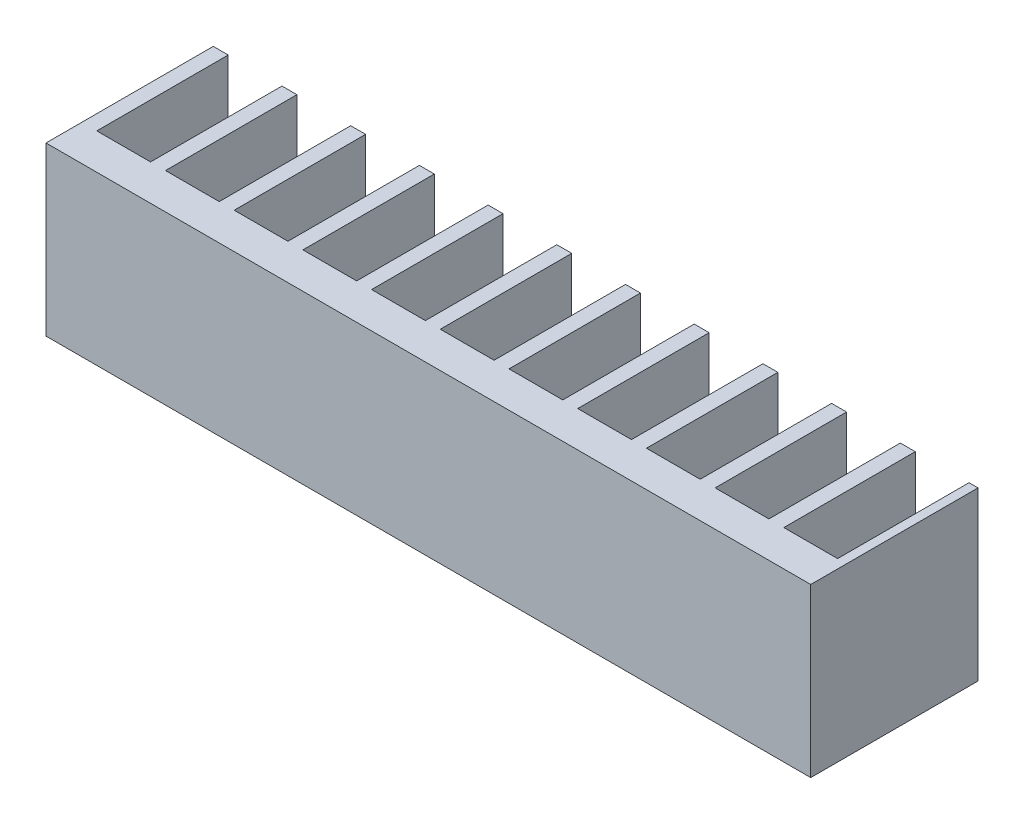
from build123d import *

# Parameters (mm, degrees)
BOSS_EXTRUDE1_DEPTH = 14


with BuildPart() as part:
    # Sketch1 → Boss-Extrude1 (new body)
    with BuildSketch(Plane(origin=(0, 0, 0), x_dir=(1, 0, 0), z_dir=(0, 1, 0))):
        Polygon((-30.75, 7), (-30.75, -4), (-26.25, -4), (-26.25, 7), (-25, 7), (-25, -4), (-20.5, -4), (-20.5, 7), (-19.25, 7), (-19.25, -4), (-14.75, -4), (-14.75, 7), (-13.5, 7), (-13.5, -4), (-9, -4), (-9, 7), (-7.75, 7), (-7.75, -4), (-3.25, -4), (-3.25, 7), (-2, 7), (-2, -4), (2.5, -4), (2.5, 7), (3.75, 7), (3.75, -4), (8.25, -4), (8.25, 7), (9.5, 7), (9.5, -4), (14, -4), (14, 7), (15.25, 7), (15.25, -4), (19.75, -4), (19.75, 7), (21, 7), (21, -4), (25.5, -4), (25.5, 7), (26.75, 7), (26.75, -4), (31.25, -4), (31.25, 7), (32, 7), (32, -7), (-32, -7), (-32, 7), align=None)
    extrude(amount=BOSS_EXTRUDE1_DEPTH)


solid = part.part
